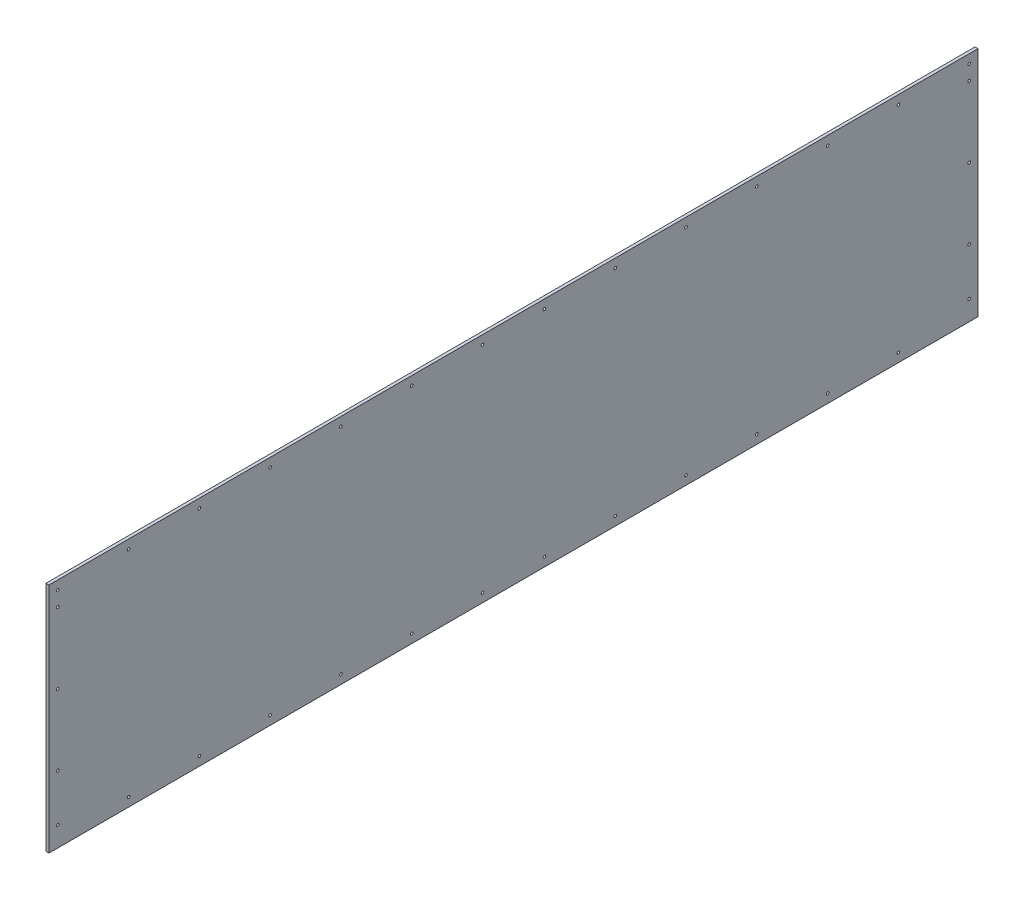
from build123d import *

# Parameters (mm, degrees)
SKETCH1_W           = 2000.25
SKETCH1_H           = 550.799
BOSS_EXTRUDE1_DEPTH = 6.35
SKETCH2_R           = 2.8067
CUT_EXTRUDE1_DEPTH  = 2075.709599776
SKETCH4_W           = 2000.25
SKETCH4_H           = 50.8
CUT_EXTRUDE2_DEPTH  = 2075.709599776


with BuildPart() as part:
    # Sketch1 → Boss-Extrude1 (new body)
    with BuildSketch(Plane(origin=(0, 0, 0), x_dir=(0, 0, -1), z_dir=(1, 0, 0))):
        with Locations((1000.125, 275.3995)):
            Rectangle(SKETCH1_W, SKETCH1_H)
    extrude(amount=BOSS_EXTRUDE1_DEPTH)

    # Sketch2 → Cut-Extrude1 (cut, through all)
    with BuildSketch(Plane(origin=(6.35, 0, 0), x_dir=(0, 0, -1), z_dir=(1, 0, 0))):
        with Locations((19.05, 531.749)):
            Circle(SKETCH2_R)
        with Locations((19.05, 347.599)):
            Circle(SKETCH2_R)
        with Locations(Location((171.45, 69.85, 0), (0, 0, 180))):
            Circle(SKETCH2_R)
        with Locations((19.05, 195.199)):
            Circle(SKETCH2_R)
        with Locations((19.05, 93.599)):
            Circle(SKETCH2_R)
        with Locations(Location((323.85, 69.85, 0), (0, 0, 180))):
            Circle(SKETCH2_R)
        with Locations(Location((476.25, 69.85, 0), (0, 0, 180))):
            Circle(SKETCH2_R)
        with Locations(Location((628.65, 69.85, 0), (0, 0, 180))):
            Circle(SKETCH2_R)
        with Locations(Location((781.05, 69.85, 0), (0, 0, 180))):
            Circle(SKETCH2_R)
        with Locations(Location((933.45, 69.85, 0), (0, 0, 180))):
            Circle(SKETCH2_R)
        with Locations(Location((1066.8, 69.85, 0), (0, 0, 180))):
            Circle(SKETCH2_R)
        with Locations(Location((1219.2, 69.85, 0), (0, 0, 180))):
            Circle(SKETCH2_R)
        with Locations(Location((1371.6, 69.85, 0), (0, 0, 180))):
            Circle(SKETCH2_R)
        with Locations(Location((1524, 69.85, 0), (0, 0, 180))):
            Circle(SKETCH2_R)
        with Locations((1981.2, 195.199)):
            Circle(SKETCH2_R)
        with Locations(Location((1676.4, 69.85, 0), (0, 0, 180))):
            Circle(SKETCH2_R)
        with Locations(Location((1828.8, 69.85, 0), (0, 0, 180))):
            Circle(SKETCH2_R)
        with Locations((1981.2, 93.599)):
            Circle(SKETCH2_R)
        with Locations((19.05, 499.999)):
            Circle(SKETCH2_R)
        with Locations((171.45, 531.749)):
            Circle(SKETCH2_R)
        with Locations((323.85, 531.749)):
            Circle(SKETCH2_R)
        with Locations((476.25, 531.749)):
            Circle(SKETCH2_R)
        with Locations((628.65, 531.749)):
            Circle(SKETCH2_R)
        with Locations((781.05, 531.749)):
            Circle(SKETCH2_R)
        with Locations((933.45, 531.749)):
            Circle(SKETCH2_R)
        with Locations((1066.8, 531.749)):
            Circle(SKETCH2_R)
        with Locations((1219.2, 531.749)):
            Circle(SKETCH2_R)
        with Locations((1371.6, 531.749)):
            Circle(SKETCH2_R)
        with Locations((1524, 531.749)):
            Circle(SKETCH2_R)
        with Locations((1676.4, 531.749)):
            Circle(SKETCH2_R)
        with Locations((1828.8, 531.749)):
            Circle(SKETCH2_R)
        with Locations((1981.2, 531.749)):
            Circle(SKETCH2_R)
        with Locations((1981.2, 499.999)):
            Circle(SKETCH2_R)
        with Locations((1981.2, 347.599)):
            Circle(SKETCH2_R)
    extrude(amount=-CUT_EXTRUDE1_DEPTH, mode=Mode.SUBTRACT)

    # Sketch4 → Cut-Extrude2 (cut, through all)
    with BuildSketch(Plane.ZY):
        with Locations((-1000.125, 25.4)):
            Rectangle(SKETCH4_W, SKETCH4_H)
    extrude(amount=-CUT_EXTRUDE2_DEPTH, mode=Mode.SUBTRACT)


solid = part.part
